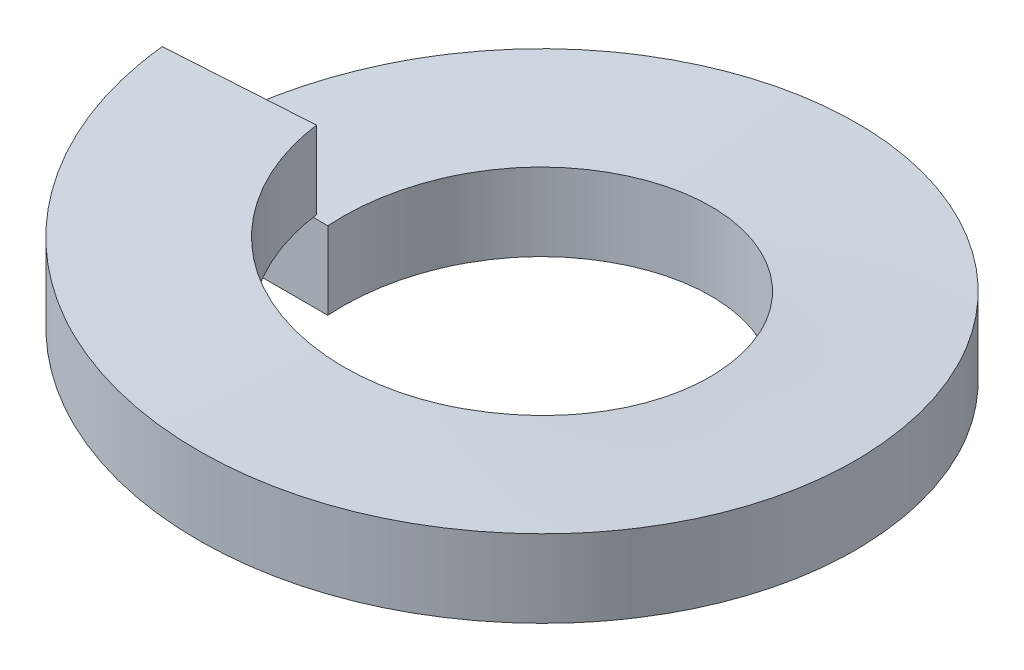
ISO-10303-21;
HEADER;
FILE_DESCRIPTION(('STEP AP214'),'2;1');
FILE_NAME('part.step','',(''),(''),'','','');
FILE_SCHEMA(('AUTOMOTIVE_DESIGN { 1 0 10303 214 1 1 1 1 }'));
ENDSEC;
DATA;
#1=APPLICATION_CONTEXT('core data for automotive mechanical design processes');
#2=APPLICATION_PROTOCOL_DEFINITION('international standard','automotive_design',2000,#1);
#3=PRODUCT_CONTEXT('',#1,'mechanical');
#4=PRODUCT('Part','Part','',(#3));
#5=PRODUCT_RELATED_PRODUCT_CATEGORY('part','',(#4));
#6=PRODUCT_DEFINITION_FORMATION('','',#4);
#7=PRODUCT_DEFINITION_CONTEXT('part definition',#1,'design');
#8=PRODUCT_DEFINITION('design','',#6,#7);
#9=PRODUCT_DEFINITION_SHAPE('','',#8);
#10=(LENGTH_UNIT() NAMED_UNIT(*) SI_UNIT(.MILLI.,.METRE.));
#11=(NAMED_UNIT(*) PLANE_ANGLE_UNIT() SI_UNIT($,.RADIAN.));
#12=(NAMED_UNIT(*) SI_UNIT($,.STERADIAN.) SOLID_ANGLE_UNIT());
#13=UNCERTAINTY_MEASURE_WITH_UNIT(LENGTH_MEASURE(1.E-05),#10,'distance_accuracy_value','');
#14=(GEOMETRIC_REPRESENTATION_CONTEXT(3) GLOBAL_UNCERTAINTY_ASSIGNED_CONTEXT((#13)) GLOBAL_UNIT_ASSIGNED_CONTEXT((#10,
#11,#12)) REPRESENTATION_CONTEXT('',''));
#15=CARTESIAN_POINT('',(0.,0.,0.));
#16=DIRECTION('',(0.,0.,1.));
#17=DIRECTION('',(1.,0.,0.));
#18=AXIS2_PLACEMENT_3D('',#15,#16,#17);
#19=CARTESIAN_POINT('',(-4.318,0.,0.));
#20=DIRECTION('',(0.,0.,1.));
#21=DIRECTION('',(1.,0.,0.));
#22=AXIS2_PLACEMENT_3D('',#19,#20,#21);
#23=PLANE('',#22);
#24=DIRECTION('',(0.,-1.,0.));
#25=VECTOR('',#24,1.);
#26=CARTESIAN_POINT('',(-4.318,1.016,0.));
#27=LINE('',#26,#25);
#28=CARTESIAN_POINT('',(-4.318,1.016,0.));
#29=VERTEX_POINT('',#28);
#30=CARTESIAN_POINT('',(-4.318,0.,0.));
#31=VERTEX_POINT('',#30);
#32=EDGE_CURVE('E87',#29,#31,#27,.T.);
#33=ORIENTED_EDGE('',*,*,#32,.T.);
#34=DIRECTION('',(1.,0.,0.));
#35=VECTOR('',#34,1.);
#36=CARTESIAN_POINT('',(-4.318,0.,0.));
#37=LINE('',#36,#35);
#38=CARTESIAN_POINT('',(-2.413,0.,0.));
#39=VERTEX_POINT('',#38);
#40=EDGE_CURVE('E80',#31,#39,#37,.T.);
#41=ORIENTED_EDGE('',*,*,#40,.T.);
#42=DIRECTION('',(0.,1.,0.));
#43=VECTOR('',#42,1.);
#44=CARTESIAN_POINT('',(-2.413,1.016,0.));
#45=LINE('',#44,#43);
#46=CARTESIAN_POINT('',(-2.413,1.016,0.));
#47=VERTEX_POINT('',#46);
#48=EDGE_CURVE('E75',#39,#47,#45,.T.);
#49=ORIENTED_EDGE('',*,*,#48,.T.);
#50=DIRECTION('',(-1.,0.,0.));
#51=VECTOR('',#50,1.);
#52=CARTESIAN_POINT('',(-4.318,1.016,0.));
#53=LINE('',#52,#51);
#54=EDGE_CURVE('E70',#47,#29,#53,.T.);
#55=ORIENTED_EDGE('',*,*,#54,.T.);
#56=EDGE_LOOP('',(#33,#41,#49,#55));
#57=FACE_BOUND('',#56,.T.);
#58=ADVANCED_FACE('F35',(#57),#23,.T.);
#59=CARTESIAN_POINT('',(-4.30947941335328,1.2192,0.271129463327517));
#60=DIRECTION('',(0.0627905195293,0.,0.998026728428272));
#61=DIRECTION('',(0.998026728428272,0.,-0.0627905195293));
#62=AXIS2_PLACEMENT_3D('',#59,#60,#61);
#63=PLANE('',#62);
#64=DIRECTION('',(0.,-1.,0.));
#65=VECTOR('',#64,1.);
#66=CARTESIAN_POINT('',(-4.30947941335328,2.2352,0.271129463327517));
#67=LINE('',#66,#65);
#68=CARTESIAN_POINT('',(-4.30947941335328,2.2352,0.271129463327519));
#69=VERTEX_POINT('',#68);
#70=CARTESIAN_POINT('',(-4.30947941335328,1.2192,0.271129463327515));
#71=VERTEX_POINT('',#70);
#72=EDGE_CURVE('E95',#69,#71,#67,.T.);
#73=ORIENTED_EDGE('',*,*,#72,.F.);
#74=DIRECTION('',(-0.998026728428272,0.,0.0627905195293));
#75=VECTOR('',#74,1.);
#76=CARTESIAN_POINT('',(-4.30947941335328,2.2352,0.271129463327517));
#77=LINE('',#76,#75);
#78=CARTESIAN_POINT('',(-2.40823849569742,2.2352,0.151513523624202));
#79=VERTEX_POINT('',#78);
#80=EDGE_CURVE('E11',#79,#69,#77,.T.);
#81=ORIENTED_EDGE('',*,*,#80,.F.);
#82=DIRECTION('',(0.,1.,0.));
#83=VECTOR('',#82,1.);
#84=CARTESIAN_POINT('',(-2.40823849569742,2.2352,0.151513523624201));
#85=LINE('',#84,#83);
#86=CARTESIAN_POINT('',(-2.40823849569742,1.2192,0.1515135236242));
#87=VERTEX_POINT('',#86);
#88=EDGE_CURVE('E49',#87,#79,#85,.T.);
#89=ORIENTED_EDGE('',*,*,#88,.F.);
#90=DIRECTION('',(0.998026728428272,0.,-0.0627905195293));
#91=VECTOR('',#90,1.);
#92=CARTESIAN_POINT('',(-4.30947941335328,1.2192,0.271129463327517));
#93=LINE('',#92,#91);
#94=EDGE_CURVE('E58',#71,#87,#93,.T.);
#95=ORIENTED_EDGE('',*,*,#94,.F.);
#96=EDGE_LOOP('',(#73,#81,#89,#95));
#97=FACE_BOUND('',#96,.T.);
#98=ADVANCED_FACE('F141',(#97),#63,.F.);
#99=CARTESIAN_POINT('',(0.,0.,0.));
#100=DIRECTION('',(0.,1.,0.));
#101=DIRECTION('',(0.,0.,1.));
#102=AXIS2_PLACEMENT_3D('',#99,#100,#101);
#103=CYLINDRICAL_SURFACE('',#102,4.318);
#104=CARTESIAN_POINT('',(-4.318,0.,0.));
#105=CARTESIAN_POINT('',(-4.318,0.1016,-2.46294371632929));
#106=CARTESIAN_POINT('',(-2.19804083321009,0.2032,-3.71668407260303));
#107=CARTESIAN_POINT('',(-0.0780816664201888,0.3048,-4.97042442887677));
#108=CARTESIAN_POINT('',(2.08021236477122,0.4064,-3.78389224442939));
#109=CARTESIAN_POINT('',(4.23850639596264,0.508,-2.59736005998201));
#110=CARTESIAN_POINT('',(4.31586932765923,0.6096,-0.135631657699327));
#111=CARTESIAN_POINT('',(4.39323225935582,0.7112,2.32609674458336));
#112=CARTESIAN_POINT('',(2.31370010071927,0.8128,3.64580798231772));
#113=CARTESIAN_POINT('',(0.234167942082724,0.9144,4.96551922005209));
#114=CARTESIAN_POINT('',(-1.96033097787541,1.016,3.84736617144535));
#115=CARTESIAN_POINT('',(-4.15482989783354,1.1176,2.72921312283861));
#116=CARTESIAN_POINT('',(-4.30947941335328,1.2192,0.271129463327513));
#117=(BOUNDED_CURVE() B_SPLINE_CURVE(2,(#104,#105,#106,#107,#108,#109,#110,#111,#112,#113,#114,
#115,#116),.UNSPECIFIED.,.F.,.F.) B_SPLINE_CURVE_WITH_KNOTS((3,2,2,2,2,2,3),(0.,
0.166666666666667,0.333333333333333,0.5,0.666666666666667,0.833333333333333,1.),
.UNSPECIFIED.) CURVE() GEOMETRIC_REPRESENTATION_ITEM() RATIONAL_B_SPLINE_CURVE((1.,
0.868631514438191,1.,0.868631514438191,1.,0.868631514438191,1.,0.868631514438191,1.,
0.868631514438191,1.,0.868631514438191,1.)) REPRESENTATION_ITEM(''));
#118=EDGE_CURVE('E90',#31,#71,#117,.T.);
#119=ORIENTED_EDGE('',*,*,#118,.F.);
#120=ORIENTED_EDGE('',*,*,#32,.F.);
#121=CARTESIAN_POINT('',(-4.318,1.016,0.));
#122=CARTESIAN_POINT('',(-4.318,1.1176,-2.46294371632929));
#123=CARTESIAN_POINT('',(-2.1980408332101,1.2192,-3.71668407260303));
#124=CARTESIAN_POINT('',(-0.078081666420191,1.3208,-4.97042442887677));
#125=CARTESIAN_POINT('',(2.08021236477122,1.4224,-3.78389224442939));
#126=CARTESIAN_POINT('',(4.23850639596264,1.524,-2.59736005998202));
#127=CARTESIAN_POINT('',(4.31586932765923,1.6256,-0.135631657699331));
#128=CARTESIAN_POINT('',(4.39323225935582,1.7272,2.32609674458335));
#129=CARTESIAN_POINT('',(2.31370010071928,1.8288,3.64580798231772));
#130=CARTESIAN_POINT('',(0.234167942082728,1.9304,4.96551922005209));
#131=CARTESIAN_POINT('',(-1.9603309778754,2.032,3.84736617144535));
#132=CARTESIAN_POINT('',(-4.15482989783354,2.1336,2.72921312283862));
#133=CARTESIAN_POINT('',(-4.30947941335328,2.2352,0.271129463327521));
#134=(BOUNDED_CURVE() B_SPLINE_CURVE(2,(#121,#122,#123,#124,#125,#126,#127,#128,#129,#130,#131,
#132,#133),.UNSPECIFIED.,.F.,.F.) B_SPLINE_CURVE_WITH_KNOTS((3,2,2,2,2,2,3),(0.,
0.166666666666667,0.333333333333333,0.5,0.666666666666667,0.833333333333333,1.),
.UNSPECIFIED.) CURVE() GEOMETRIC_REPRESENTATION_ITEM() RATIONAL_B_SPLINE_CURVE((1.,
0.868631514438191,1.,0.868631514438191,1.,0.868631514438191,1.,0.868631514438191,1.,
0.868631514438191,1.,0.868631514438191,1.)) REPRESENTATION_ITEM(''));
#135=EDGE_CURVE('E89',#29,#69,#134,.T.);
#136=ORIENTED_EDGE('',*,*,#135,.T.);
#137=ORIENTED_EDGE('',*,*,#72,.T.);
#138=EDGE_LOOP('',(#119,#120,#136,#137));
#139=FACE_BOUND('',#138,.T.);
#140=ADVANCED_FACE('F88',(#139),#103,.T.);
#141=CARTESIAN_POINT('',(-4.318,0.,0.));
#142=CARTESIAN_POINT('',(-4.318,0.1016,-2.46294371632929));
#143=CARTESIAN_POINT('',(-2.19804083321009,0.2032,-3.71668407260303));
#144=CARTESIAN_POINT('',(-0.0780816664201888,0.3048,-4.97042442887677));
#145=CARTESIAN_POINT('',(2.08021236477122,0.4064,-3.78389224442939));
#146=CARTESIAN_POINT('',(4.23850639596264,0.508,-2.59736005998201));
#147=CARTESIAN_POINT('',(4.31586932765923,0.6096,-0.135631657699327));
#148=CARTESIAN_POINT('',(4.39323225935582,0.7112,2.32609674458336));
#149=CARTESIAN_POINT('',(2.31370010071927,0.8128,3.64580798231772));
#150=CARTESIAN_POINT('',(0.234167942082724,0.9144,4.96551922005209));
#151=CARTESIAN_POINT('',(-1.96033097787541,1.016,3.84736617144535));
#152=CARTESIAN_POINT('',(-4.15482989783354,1.1176,2.72921312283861));
#153=CARTESIAN_POINT('',(-4.30947941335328,1.2192,0.271129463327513));
#154=CARTESIAN_POINT('',(-2.413,0.,0.));
#155=CARTESIAN_POINT('',(-2.413,0.1016,-1.37635090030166));
#156=CARTESIAN_POINT('',(-1.22831693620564,0.2032,-2.07697051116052));
#157=CARTESIAN_POINT('',(-0.043633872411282,0.3048,-2.77759012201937));
#158=CARTESIAN_POINT('',(1.16247161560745,0.4064,-2.11452801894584));
#159=CARTESIAN_POINT('',(2.36857710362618,0.508,-1.4514659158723));
#160=CARTESIAN_POINT('',(2.41180933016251,0.6096,-0.0757941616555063));
#161=CARTESIAN_POINT('',(2.45504155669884,0.7112,1.29987759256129));
#162=CARTESIAN_POINT('',(1.2929500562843,0.8128,2.03736328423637));
#163=CARTESIAN_POINT('',(0.130858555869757,0.9144,2.77484897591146));
#164=CARTESIAN_POINT('',(-1.09547907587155,1.016,2.14999874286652));
#165=CARTESIAN_POINT('',(-2.32181670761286,1.1176,1.52514850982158));
#166=CARTESIAN_POINT('',(-2.40823849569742,1.2192,0.151513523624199));
#167=(BOUNDED_SURFACE() B_SPLINE_SURFACE(1,2,((#141,#142,#143,#144,#145,#146,#147,#148,#149,
#150,#151,#152,#153),(#154,#155,#156,#157,#158,#159,#160,#161,#162,#163,#164,#165,#166)),
.UNSPECIFIED.,.F.,.F.,.F.) B_SPLINE_SURFACE_WITH_KNOTS((2,2),(3,2,2,2,2,2,3),(0.,1.),(0.,
0.166666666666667,0.333333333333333,0.5,0.666666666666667,0.833333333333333,1.),
.UNSPECIFIED.) GEOMETRIC_REPRESENTATION_ITEM() RATIONAL_B_SPLINE_SURFACE(((1.,0.868631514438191,
1.,0.868631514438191,1.,0.868631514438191,1.,0.868631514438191,1.,0.868631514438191,1.,
0.868631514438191,1.),(1.,0.868631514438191,1.,0.868631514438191,1.,0.868631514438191,1.,
0.868631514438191,1.,0.868631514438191,1.,0.868631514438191,1.))) REPRESENTATION_ITEM('') SURFACE());
#168=CARTESIAN_POINT('',(-2.413,0.,0.));
#169=CARTESIAN_POINT('',(-2.413,0.1016,-1.37635090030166));
#170=CARTESIAN_POINT('',(-1.22831693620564,0.2032,-2.07697051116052));
#171=CARTESIAN_POINT('',(-0.043633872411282,0.3048,-2.77759012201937));
#172=CARTESIAN_POINT('',(1.16247161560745,0.4064,-2.11452801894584));
#173=CARTESIAN_POINT('',(2.36857710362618,0.508,-1.4514659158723));
#174=CARTESIAN_POINT('',(2.41180933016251,0.6096,-0.0757941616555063));
#175=CARTESIAN_POINT('',(2.45504155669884,0.7112,1.29987759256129));
#176=CARTESIAN_POINT('',(1.2929500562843,0.8128,2.03736328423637));
#177=CARTESIAN_POINT('',(0.130858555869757,0.9144,2.77484897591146));
#178=CARTESIAN_POINT('',(-1.09547907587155,1.016,2.14999874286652));
#179=CARTESIAN_POINT('',(-2.32181670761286,1.1176,1.52514850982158));
#180=CARTESIAN_POINT('',(-2.40823849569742,1.2192,0.151513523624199));
#181=(BOUNDED_CURVE() B_SPLINE_CURVE(2,(#168,#169,#170,#171,#172,#173,#174,#175,#176,#177,#178,
#179,#180),.UNSPECIFIED.,.F.,.F.) B_SPLINE_CURVE_WITH_KNOTS((3,2,2,2,2,2,3),(0.,
0.166666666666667,0.333333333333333,0.5,0.666666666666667,0.833333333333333,1.),
.UNSPECIFIED.) CURVE() GEOMETRIC_REPRESENTATION_ITEM() RATIONAL_B_SPLINE_CURVE((1.,
0.868631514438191,1.,0.868631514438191,1.,0.868631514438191,1.,0.868631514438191,1.,
0.868631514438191,1.,0.868631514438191,1.)) REPRESENTATION_ITEM(''));
#182=EDGE_CURVE('E110',#39,#87,#181,.T.);
#183=ORIENTED_EDGE('',*,*,#182,.F.);
#184=ORIENTED_EDGE('',*,*,#40,.F.);
#185=ORIENTED_EDGE('',*,*,#118,.T.);
#186=ORIENTED_EDGE('',*,*,#94,.T.);
#187=EDGE_LOOP('',(#183,#184,#185,#186));
#188=FACE_BOUND('',#187,.T.);
#189=ADVANCED_FACE('F128',(#188),#167,.F.);
#190=CARTESIAN_POINT('',(0.,0.,0.));
#191=DIRECTION('',(0.,1.,0.));
#192=DIRECTION('',(0.,0.,1.));
#193=AXIS2_PLACEMENT_3D('',#190,#191,#192);
#194=CYLINDRICAL_SURFACE('',#193,2.413);
#195=CARTESIAN_POINT('',(-2.413,1.016,0.));
#196=CARTESIAN_POINT('',(-2.413,1.1176,-1.37635090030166));
#197=CARTESIAN_POINT('',(-1.22831693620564,1.2192,-2.07697051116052));
#198=CARTESIAN_POINT('',(-0.0436338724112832,1.3208,-2.77759012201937));
#199=CARTESIAN_POINT('',(1.16247161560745,1.4224,-2.11452801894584));
#200=CARTESIAN_POINT('',(2.36857710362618,1.524,-1.4514659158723));
#201=CARTESIAN_POINT('',(2.41180933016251,1.6256,-0.0757941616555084));
#202=CARTESIAN_POINT('',(2.45504155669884,1.7272,1.29987759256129));
#203=CARTESIAN_POINT('',(1.2929500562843,1.8288,2.03736328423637));
#204=CARTESIAN_POINT('',(0.13085855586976,1.9304,2.77484897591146));
#205=CARTESIAN_POINT('',(-1.09547907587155,2.032,2.14999874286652));
#206=CARTESIAN_POINT('',(-2.32181670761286,2.1336,1.52514850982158));
#207=CARTESIAN_POINT('',(-2.40823849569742,2.2352,0.151513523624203));
#208=(BOUNDED_CURVE() B_SPLINE_CURVE(2,(#195,#196,#197,#198,#199,#200,#201,#202,#203,#204,#205,
#206,#207),.UNSPECIFIED.,.F.,.F.) B_SPLINE_CURVE_WITH_KNOTS((3,2,2,2,2,2,3),(0.,
0.166666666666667,0.333333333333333,0.5,0.666666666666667,0.833333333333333,1.),
.UNSPECIFIED.) CURVE() GEOMETRIC_REPRESENTATION_ITEM() RATIONAL_B_SPLINE_CURVE((1.,
0.868631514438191,1.,0.868631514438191,1.,0.868631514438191,1.,0.868631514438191,1.,
0.868631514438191,1.,0.868631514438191,1.)) REPRESENTATION_ITEM(''));
#209=EDGE_CURVE('E42',#47,#79,#208,.T.);
#210=ORIENTED_EDGE('',*,*,#209,.F.);
#211=ORIENTED_EDGE('',*,*,#48,.F.);
#212=ORIENTED_EDGE('',*,*,#182,.T.);
#213=ORIENTED_EDGE('',*,*,#88,.T.);
#214=EDGE_LOOP('',(#210,#211,#212,#213));
#215=FACE_BOUND('',#214,.T.);
#216=ADVANCED_FACE('F126',(#215),#194,.F.);
#217=CARTESIAN_POINT('',(-2.413,1.016,0.));
#218=CARTESIAN_POINT('',(-2.413,1.1176,-1.37635090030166));
#219=CARTESIAN_POINT('',(-1.22831693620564,1.2192,-2.07697051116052));
#220=CARTESIAN_POINT('',(-0.0436338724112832,1.3208,-2.77759012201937));
#221=CARTESIAN_POINT('',(1.16247161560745,1.4224,-2.11452801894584));
#222=CARTESIAN_POINT('',(2.36857710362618,1.524,-1.4514659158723));
#223=CARTESIAN_POINT('',(2.41180933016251,1.6256,-0.0757941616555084));
#224=CARTESIAN_POINT('',(2.45504155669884,1.7272,1.29987759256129));
#225=CARTESIAN_POINT('',(1.2929500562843,1.8288,2.03736328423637));
#226=CARTESIAN_POINT('',(0.13085855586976,1.9304,2.77484897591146));
#227=CARTESIAN_POINT('',(-1.09547907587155,2.032,2.14999874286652));
#228=CARTESIAN_POINT('',(-2.32181670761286,2.1336,1.52514850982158));
#229=CARTESIAN_POINT('',(-2.40823849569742,2.2352,0.151513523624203));
#230=CARTESIAN_POINT('',(-4.318,1.016,0.));
#231=CARTESIAN_POINT('',(-4.318,1.1176,-2.46294371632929));
#232=CARTESIAN_POINT('',(-2.1980408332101,1.2192,-3.71668407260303));
#233=CARTESIAN_POINT('',(-0.078081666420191,1.3208,-4.97042442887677));
#234=CARTESIAN_POINT('',(2.08021236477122,1.4224,-3.78389224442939));
#235=CARTESIAN_POINT('',(4.23850639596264,1.524,-2.59736005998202));
#236=CARTESIAN_POINT('',(4.31586932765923,1.6256,-0.135631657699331));
#237=CARTESIAN_POINT('',(4.39323225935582,1.7272,2.32609674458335));
#238=CARTESIAN_POINT('',(2.31370010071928,1.8288,3.64580798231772));
#239=CARTESIAN_POINT('',(0.234167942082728,1.9304,4.96551922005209));
#240=CARTESIAN_POINT('',(-1.9603309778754,2.032,3.84736617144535));
#241=CARTESIAN_POINT('',(-4.15482989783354,2.1336,2.72921312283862));
#242=CARTESIAN_POINT('',(-4.30947941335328,2.2352,0.271129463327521));
#243=(BOUNDED_SURFACE() B_SPLINE_SURFACE(1,2,((#217,#218,#219,#220,#221,#222,#223,#224,#225,
#226,#227,#228,#229),(#230,#231,#232,#233,#234,#235,#236,#237,#238,#239,#240,#241,#242)),
.UNSPECIFIED.,.F.,.F.,.F.) B_SPLINE_SURFACE_WITH_KNOTS((2,2),(3,2,2,2,2,2,3),(0.,1.),(0.,
0.166666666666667,0.333333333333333,0.5,0.666666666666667,0.833333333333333,1.),
.UNSPECIFIED.) GEOMETRIC_REPRESENTATION_ITEM() RATIONAL_B_SPLINE_SURFACE(((1.,0.868631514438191,
1.,0.868631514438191,1.,0.868631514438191,1.,0.868631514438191,1.,0.868631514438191,1.,
0.868631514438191,1.),(1.,0.868631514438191,1.,0.868631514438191,1.,0.868631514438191,1.,
0.868631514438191,1.,0.868631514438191,1.,0.868631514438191,1.))) REPRESENTATION_ITEM('') SURFACE());
#244=ORIENTED_EDGE('',*,*,#80,.T.);
#245=ORIENTED_EDGE('',*,*,#135,.F.);
#246=ORIENTED_EDGE('',*,*,#54,.F.);
#247=ORIENTED_EDGE('',*,*,#209,.T.);
#248=EDGE_LOOP('',(#244,#245,#246,#247));
#249=FACE_BOUND('',#248,.T.);
#250=ADVANCED_FACE('F93',(#249),#243,.F.);
#251=CLOSED_SHELL('',(#58,#98,#140,#189,#216,#250));
#252=MANIFOLD_SOLID_BREP('B2',#251);
#253=ADVANCED_BREP_SHAPE_REPRESENTATION('',(#18,#252),#14);
#254=SHAPE_DEFINITION_REPRESENTATION(#9,#253);
ENDSEC;
END-ISO-10303-21;
